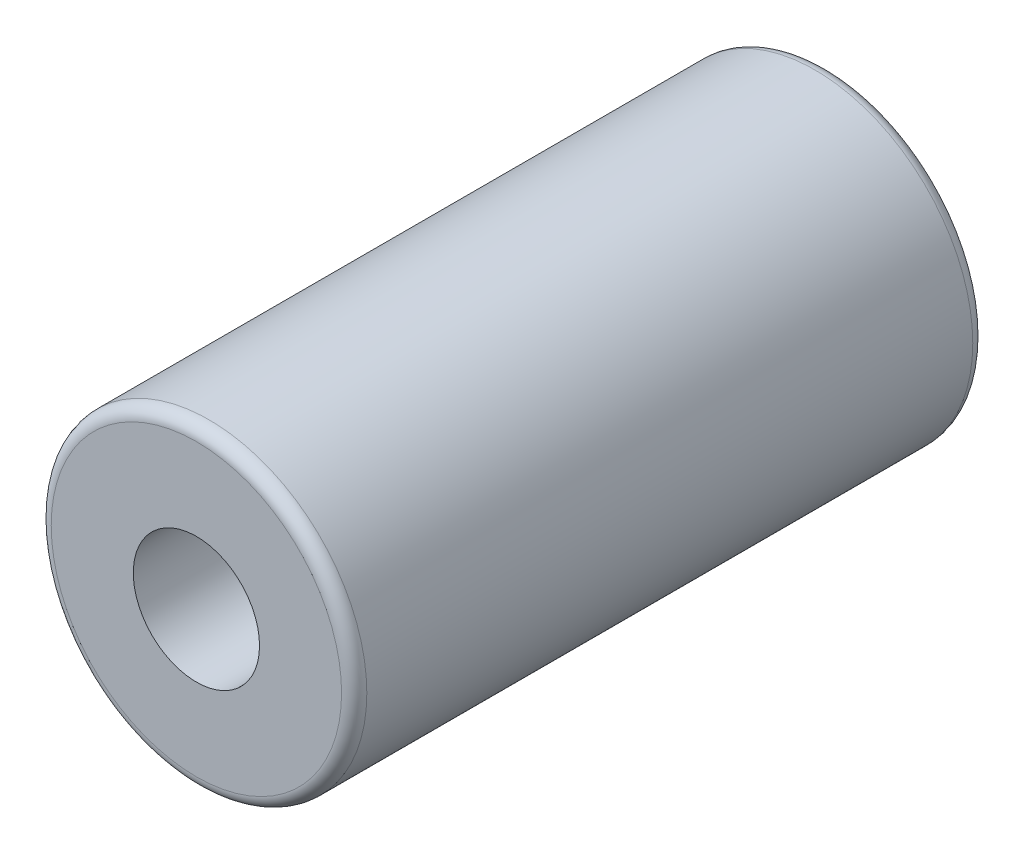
from build123d import *

# Parameters (mm, degrees)
SKETCH1_R           = 31.75
SKETCH1_R_2         = 12.7
BOSS_EXTRUDE1_DEPTH = 127
FILLET1_R           = 2.54


with BuildPart() as part:
    # Sketch1 → Boss-Extrude1 (new body)
    with BuildSketch(Plane.XY):
        Circle(SKETCH1_R)
        Circle(SKETCH1_R_2, mode=Mode.SUBTRACT)
    extrude(amount=BOSS_EXTRUDE1_DEPTH)

    # Fillet1
    fillet1_edges = [part.edges().sort_by_distance(p)[0] for p in [
        (-31.75, 0, 0),
        (-31.75, 0, 127),
    ]]
    fillet(fillet1_edges, radius=FILLET1_R)


solid = part.part
